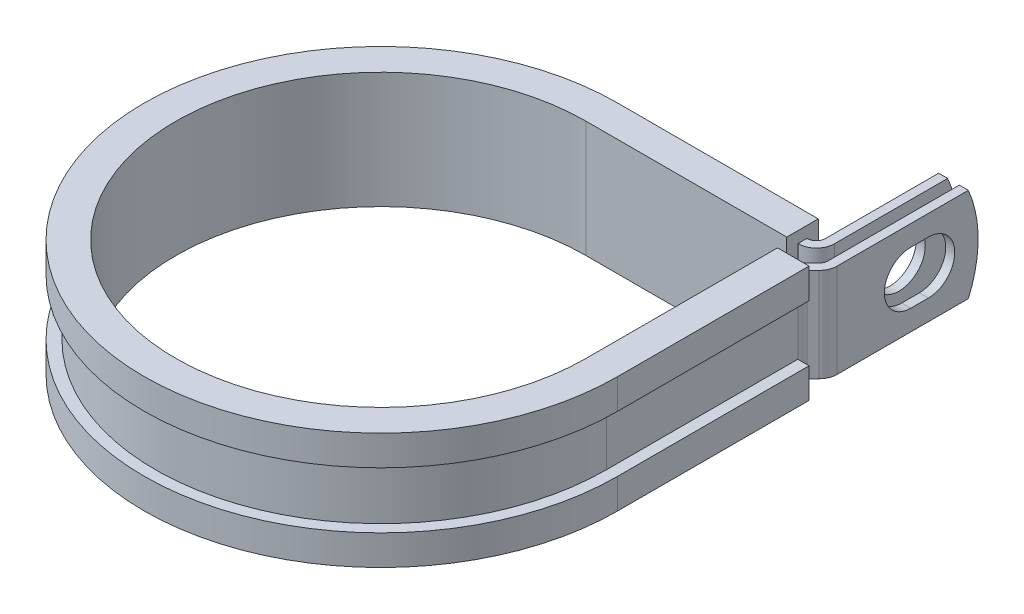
from build123d import *

# Parameters (mm, degrees)
EXTRUDE_THIN1_DEPTH = 6.35
SKETCH2_R           = 3.5687
CUT_EXTRUDE1_DEPTH  = 1.2192
CUT_EXTRUDE2_DEPTH  = 1.2192
CUT_EXTRUDE3_DEPTH  = 77.506509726


with BuildPart() as part:
    # Sketch1 → Extrude-Thin1 (new, symmetric)
    with BuildSketch(Plane(origin=(0, 0, 0), x_dir=(1, 0, 0), z_dir=(0, 1, 0))):
        with BuildLine():
            Line((31.1963698, 48.387), (31.1963698, 29.2989))
            ThreePointArc((31.1963698, 29.2989), (31.103563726, 28.832332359), (30.839274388, 28.436795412))
            Line((30.839274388, 28.436795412), (30.013090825, 27.610611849))
            ThreePointArc((30.013090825, 27.610611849), (29.484512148, 26.819537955), (29.2989, 25.886402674))
            Line((29.2989, 25.886402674), (29.2989, 0))
            ThreePointArc((29.2989, 0), (-20.717450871, -20.717450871), (0, 29.2989))
            Line((0, 29.2989), (27.1831698, 29.2989))
            ThreePointArc((27.1831698, 29.2989), (28.907378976, 30.013090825), (29.6215698, 31.7373))
            Line((29.6215698, 31.7373), (29.6215698, 48.387))
            Line((29.6215698, 48.387), (28.4023698, 48.387))
            Line((28.4023698, 48.387), (28.4023698, 31.7373))
            ThreePointArc((28.4023698, 31.7373), (28.045274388, 30.875195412), (27.1831698, 30.5181))
            Line((27.1831698, 30.5181), (0, 30.5181))
            ThreePointArc((0, 30.5181), (-21.579555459, -21.579555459), (30.5181, 0))
            Line((30.5181, 0), (30.5181, 25.886402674))
            ThreePointArc((30.5181, 25.886402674), (30.610906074, 26.352970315), (30.875195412, 26.748507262))
            Line((30.875195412, 26.748507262), (31.701378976, 27.574690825))
            ThreePointArc((31.701378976, 27.574690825), (32.229957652, 28.365764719), (32.4155698, 29.2989))
            Line((32.4155698, 29.2989), (32.4155698, 48.387))
            Line((32.4155698, 48.387), (31.1963698, 48.387))
        make_face()
    extrude(amount=EXTRUDE_THIN1_DEPTH, both=True)

    # Sketch2 → Cut-Extrude1 (cut)
    with BuildSketch(Plane.ZY.offset(-28.4023698)):
        with Locations((-40.4622, 0)):
            Circle(SKETCH2_R)
    extrude(amount=-CUT_EXTRUDE1_DEPTH, mode=Mode.SUBTRACT)

    # Sketch3 → Cut-Extrude2 (cut)
    with BuildSketch(Plane(origin=(32.4155698, 0, 0), x_dir=(0, 0, -1), z_dir=(1, 0, 0))):
        with BuildLine():
            Line((39.2684, 3.5687), (41.656, 3.5687))
            ThreePointArc((41.656, 3.5687), (45.2247, 0), (41.656, -3.5687))
            Line((41.656, -3.5687), (39.2684, -3.5687))
            ThreePointArc((39.2684, -3.5687), (35.6997, 0), (39.2684, 3.5687))
        make_face()
    extrude(amount=-CUT_EXTRUDE2_DEPTH, mode=Mode.SUBTRACT)

    # Sketch4 → Cut-Extrude3 (cut, through all)
    with BuildSketch(Plane.ZY.offset(-28.4023698)):
        with BuildLine():
            Line((-47.061677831, 6.35), (-48.387, 6.35))
            Line((-48.387, 6.35), (-48.387, 0))
            ThreePointArc((-48.387, 0), (-48.052137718, 3.243415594), (-47.061677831, 6.35))
        make_face()
        with BuildLine():
            ThreePointArc((-47.061677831, -6.35), (-48.052137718, -3.243415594), (-48.387, 0))
            Line((-48.387, 0), (-48.387, -6.35))
            Line((-48.387, -6.35), (-47.061677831, -6.35))
        make_face()
    extrude(amount=-CUT_EXTRUDE3_DEPTH, mode=Mode.SUBTRACT)

    # Sweep1: sweep along a path in Sketch6
    with BuildLine(Plane(origin=(0, 6.35, 0), x_dir=(1, 0, 0), z_dir=(0, 1, 0))) as sweep1_path:
        Line((27.7749, 25.886402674), (27.7749, 0))
        ThreePointArc((27.7749, 0), (-19.639820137, -19.639820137), (0, 27.7749))
        Line((0, 27.7749), (27.1323698, 27.7749))
    # Sketch5 → Sweep1 (sweep)
    with BuildSketch(Plane(origin=(0, 0, -25.886402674), x_dir=(-1, 0, 0), z_dir=(0, 0, -1))):
        Polygon((-30.5181, 6.35), (-29.2989, 6.35), (-29.2989, -6.35), (-30.5181, -6.35), (-30.5181, -3.81), (-32.0421, -3.81), (-32.0421, -7.874), (-27.7749, -7.874), (-27.7749, 7.874), (-32.0421, 7.874), (-32.0421, 3.81), (-30.5181, 3.81), align=None)
    sweep(path=sweep1_path.line)


solid = part.part
